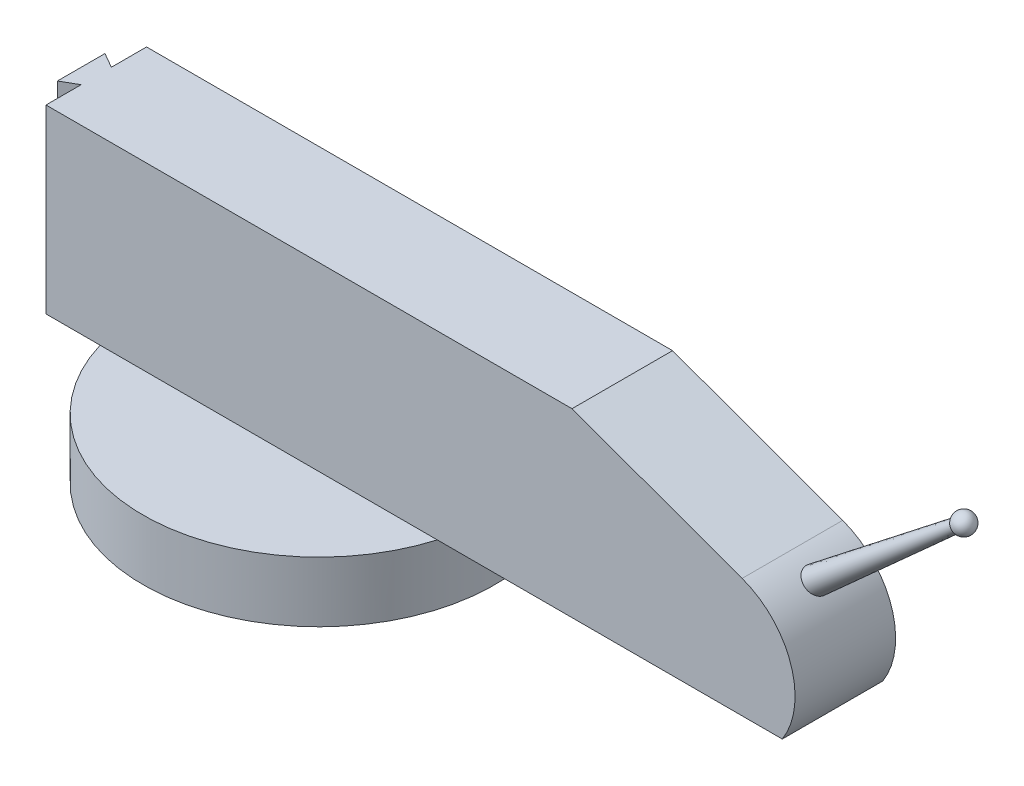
ISO-10303-21;
HEADER;
FILE_DESCRIPTION(('STEP AP214'),'2;1');
FILE_NAME('part.step','',(''),(''),'','','');
FILE_SCHEMA(('AUTOMOTIVE_DESIGN { 1 0 10303 214 1 1 1 1 }'));
ENDSEC;
DATA;
#1=APPLICATION_CONTEXT('core data for automotive mechanical design processes');
#2=APPLICATION_PROTOCOL_DEFINITION('international standard','automotive_design',2000,#1);
#3=PRODUCT_CONTEXT('',#1,'mechanical');
#4=PRODUCT('Part','Part','',(#3));
#5=PRODUCT_RELATED_PRODUCT_CATEGORY('part','',(#4));
#6=PRODUCT_DEFINITION_FORMATION('','',#4);
#7=PRODUCT_DEFINITION_CONTEXT('part definition',#1,'design');
#8=PRODUCT_DEFINITION('design','',#6,#7);
#9=PRODUCT_DEFINITION_SHAPE('','',#8);
#10=(LENGTH_UNIT() NAMED_UNIT(*) SI_UNIT(.MILLI.,.METRE.));
#11=(NAMED_UNIT(*) PLANE_ANGLE_UNIT() SI_UNIT($,.RADIAN.));
#12=(NAMED_UNIT(*) SI_UNIT($,.STERADIAN.) SOLID_ANGLE_UNIT());
#13=UNCERTAINTY_MEASURE_WITH_UNIT(LENGTH_MEASURE(1.E-05),#10,'distance_accuracy_value','');
#14=(GEOMETRIC_REPRESENTATION_CONTEXT(3) GLOBAL_UNCERTAINTY_ASSIGNED_CONTEXT((#13)) GLOBAL_UNIT_ASSIGNED_CONTEXT((#10,
#11,#12)) REPRESENTATION_CONTEXT('',''));
#15=CARTESIAN_POINT('',(0.,0.,0.));
#16=DIRECTION('',(0.,0.,1.));
#17=DIRECTION('',(1.,0.,0.));
#18=AXIS2_PLACEMENT_3D('',#15,#16,#17);
#19=CARTESIAN_POINT('',(0.,0.,10.));
#20=DIRECTION('',(0.,1.,0.));
#21=DIRECTION('',(0.,0.,1.));
#22=AXIS2_PLACEMENT_3D('',#19,#20,#21);
#23=PLANE('',#22);
#24=CARTESIAN_POINT('',(23.6473346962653,0.,5.));
#25=DIRECTION('',(0.,-1.,0.));
#26=DIRECTION('',(0.,0.,-1.));
#27=AXIS2_PLACEMENT_3D('',#24,#25,#26);
#28=CIRCLE('',#27,17.5);
#29=CARTESIAN_POINT('',(40.4178445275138,0.,0.));
#30=VERTEX_POINT('',#29);
#31=CARTESIAN_POINT('',(40.4178445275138,0.,10.));
#32=VERTEX_POINT('',#31);
#33=EDGE_CURVE('E44',#30,#32,#28,.T.);
#34=ORIENTED_EDGE('',*,*,#33,.F.);
#35=DIRECTION('',(1.,0.,0.));
#36=VECTOR('',#35,1.);
#37=CARTESIAN_POINT('',(0.,0.,0.));
#38=LINE('',#37,#36);
#39=CARTESIAN_POINT('',(74.7304290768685,0.,0.));
#40=VERTEX_POINT('',#39);
#41=EDGE_CURVE('E129',#30,#40,#38,.T.);
#42=ORIENTED_EDGE('',*,*,#41,.T.);
#43=DIRECTION('',(0.,0.,-1.));
#44=VECTOR('',#43,1.);
#45=CARTESIAN_POINT('',(74.7304290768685,0.,10.));
#46=LINE('',#45,#44);
#47=CARTESIAN_POINT('',(74.7304290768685,0.,10.));
#48=VERTEX_POINT('',#47);
#49=EDGE_CURVE('E209',#48,#40,#46,.T.);
#50=ORIENTED_EDGE('',*,*,#49,.F.);
#51=DIRECTION('',(1.,0.,0.));
#52=VECTOR('',#51,1.);
#53=CARTESIAN_POINT('',(0.,0.,10.));
#54=LINE('',#53,#52);
#55=EDGE_CURVE('E52',#32,#48,#54,.T.);
#56=ORIENTED_EDGE('',*,*,#55,.F.);
#57=EDGE_LOOP('',(#34,#42,#50,#56));
#58=FACE_BOUND('',#57,.T.);
#59=ADVANCED_FACE('F30',(#58),#23,.F.);
#60=CARTESIAN_POINT('',(6.8768248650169,0.,10.));
#61=VERTEX_POINT('',#60);
#62=CARTESIAN_POINT('',(6.8768248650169,0.,0.));
#63=VERTEX_POINT('',#62);
#64=EDGE_CURVE('E11',#61,#63,#28,.T.);
#65=ORIENTED_EDGE('',*,*,#64,.F.);
#66=CARTESIAN_POINT('',(1.5,0.,10.));
#67=VERTEX_POINT('',#66);
#68=EDGE_CURVE('E189',#67,#61,#54,.T.);
#69=ORIENTED_EDGE('',*,*,#68,.F.);
#70=DIRECTION('',(0.,0.,-1.));
#71=VECTOR('',#70,1.);
#72=CARTESIAN_POINT('',(1.5,0.,10.));
#73=LINE('',#72,#71);
#74=CARTESIAN_POINT('',(1.5,0.,6.5));
#75=VERTEX_POINT('',#74);
#76=EDGE_CURVE('E155',#67,#75,#73,.T.);
#77=ORIENTED_EDGE('',*,*,#76,.T.);
#78=DIRECTION('',(-0.866025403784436,0.,0.500000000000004));
#79=VECTOR('',#78,1.);
#80=CARTESIAN_POINT('',(1.5,0.,6.5));
#81=LINE('',#80,#79);
#82=CARTESIAN_POINT('',(0.,0.,7.36602540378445));
#83=VERTEX_POINT('',#82);
#84=EDGE_CURVE('E158',#75,#83,#81,.T.);
#85=ORIENTED_EDGE('',*,*,#84,.T.);
#86=DIRECTION('',(0.,0.,-1.));
#87=VECTOR('',#86,1.);
#88=CARTESIAN_POINT('',(0.,0.,10.));
#89=LINE('',#88,#87);
#90=CARTESIAN_POINT('',(0.,0.,2.63397459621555));
#91=VERTEX_POINT('',#90);
#92=EDGE_CURVE('E199',#83,#91,#89,.T.);
#93=ORIENTED_EDGE('',*,*,#92,.T.);
#94=DIRECTION('',(0.866025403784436,0.,0.500000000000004));
#95=VECTOR('',#94,1.);
#96=CARTESIAN_POINT('',(1.5,0.,3.5));
#97=LINE('',#96,#95);
#98=CARTESIAN_POINT('',(1.5,0.,3.5));
#99=VERTEX_POINT('',#98);
#100=EDGE_CURVE('E173',#91,#99,#97,.T.);
#101=ORIENTED_EDGE('',*,*,#100,.T.);
#102=DIRECTION('',(0.,0.,-1.));
#103=VECTOR('',#102,1.);
#104=CARTESIAN_POINT('',(1.5,0.,0.));
#105=LINE('',#104,#103);
#106=CARTESIAN_POINT('',(1.5,0.,0.));
#107=VERTEX_POINT('',#106);
#108=EDGE_CURVE('E123',#99,#107,#105,.T.);
#109=ORIENTED_EDGE('',*,*,#108,.T.);
#110=EDGE_CURVE('E118',#107,#63,#38,.T.);
#111=ORIENTED_EDGE('',*,*,#110,.T.);
#112=EDGE_LOOP('',(#65,#69,#77,#85,#93,#101,#109,#111));
#113=FACE_BOUND('',#112,.T.);
#114=ADVANCED_FACE('F120',(#113),#23,.F.);
#115=CARTESIAN_POINT('',(68.,4.32450279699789,10.));
#116=DIRECTION('',(0.,0.,-1.));
#117=DIRECTION('',(-1.,0.,0.));
#118=AXIS2_PLACEMENT_3D('',#115,#116,#117);
#119=CYLINDRICAL_SURFACE('',#118,7.99999999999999);
#120=CARTESIAN_POINT('',(68.,4.32450279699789,0.));
#121=DIRECTION('',(0.,0.,1.));
#122=DIRECTION('',(-1.,0.,0.));
#123=AXIS2_PLACEMENT_3D('',#120,#121,#122);
#124=CIRCLE('',#123,7.99999999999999);
#125=CARTESIAN_POINT('',(70.7361611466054,11.8420437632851,0.));
#126=VERTEX_POINT('',#125);
#127=EDGE_CURVE('E126',#40,#126,#124,.T.);
#128=ORIENTED_EDGE('',*,*,#127,.T.);
#129=DIRECTION('',(0.,0.,-1.));
#130=VECTOR('',#129,1.);
#131=CARTESIAN_POINT('',(70.7361611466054,11.8420437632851,10.));
#132=LINE('',#131,#130);
#133=CARTESIAN_POINT('',(70.7361611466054,11.8420437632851,10.));
#134=VERTEX_POINT('',#133);
#135=EDGE_CURVE('E206',#134,#126,#132,.T.);
#136=ORIENTED_EDGE('',*,*,#135,.F.);
#137=CARTESIAN_POINT('',(68.,4.32450279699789,10.));
#138=DIRECTION('',(0.,0.,1.));
#139=DIRECTION('',(-1.,0.,0.));
#140=AXIS2_PLACEMENT_3D('',#137,#138,#139);
#141=CIRCLE('',#140,7.99999999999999);
#142=EDGE_CURVE('E191',#48,#134,#141,.T.);
#143=ORIENTED_EDGE('',*,*,#142,.F.);
#144=ORIENTED_EDGE('',*,*,#49,.T.);
#145=EDGE_LOOP('',(#128,#136,#143,#144));
#146=FACE_BOUND('',#145,.T.);
#147=CARTESIAN_POINT('',(73.5125753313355,10.1220465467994,3.87749337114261));
#148=CARTESIAN_POINT('',(73.4662022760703,10.1661386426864,3.85098514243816));
#149=CARTESIAN_POINT('',(73.4176359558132,10.2112490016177,3.82989216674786));
#150=CARTESIAN_POINT('',(73.3173880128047,10.3019573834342,3.79906814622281));
#151=CARTESIAN_POINT('',(73.2657030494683,10.3475558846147,3.78934952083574));
#152=CARTESIAN_POINT('',(73.1607225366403,10.437744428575,3.78142861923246));
#153=CARTESIAN_POINT('',(73.1074292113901,10.4823357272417,3.78321110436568));
#154=CARTESIAN_POINT('',(73.0006665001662,10.5693470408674,3.79805306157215));
#155=CARTESIAN_POINT('',(72.9471971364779,10.6117673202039,3.8111111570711));
#156=CARTESIAN_POINT('',(72.8406121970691,10.694204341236,3.84837759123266));
#157=CARTESIAN_POINT('',(72.7875216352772,10.7341618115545,3.87278851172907));
#158=CARTESIAN_POINT('',(72.6843401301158,10.8099527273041,3.93211642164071));
#159=CARTESIAN_POINT('',(72.6342497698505,10.8457853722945,3.9670354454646));
#160=CARTESIAN_POINT('',(72.5377724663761,10.9132930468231,4.0472594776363));
#161=CARTESIAN_POINT('',(72.4914755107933,10.944874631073,4.09275169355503));
#162=CARTESIAN_POINT('',(72.4054000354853,11.0024618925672,4.19258948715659));
#163=CARTESIAN_POINT('',(72.365621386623,11.0284676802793,4.24693488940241));
#164=CARTESIAN_POINT('',(72.2947329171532,11.0740974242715,4.36228775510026));
#165=CARTESIAN_POINT('',(72.2635128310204,11.0938031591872,4.42319485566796));
#166=CARTESIAN_POINT('',(72.2105083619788,11.1268996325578,4.550577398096));
#167=CARTESIAN_POINT('',(72.1887205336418,11.1402926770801,4.61705079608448));
#168=CARTESIAN_POINT('',(72.1565174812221,11.1599767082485,4.75025265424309));
#169=CARTESIAN_POINT('',(72.1456059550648,11.1665781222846,4.81681527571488));
#170=CARTESIAN_POINT('',(72.1339390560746,11.1736339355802,4.9511396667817));
#171=CARTESIAN_POINT('',(72.1331809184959,11.174090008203,5.0189011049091));
#172=CARTESIAN_POINT('',(72.1416818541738,11.1689524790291,5.1508562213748));
#173=CARTESIAN_POINT('',(72.1505469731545,11.1635968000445,5.21508519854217));
#174=CARTESIAN_POINT('',(72.1772401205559,11.1473252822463,5.34091565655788));
#175=CARTESIAN_POINT('',(72.1950684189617,11.1364092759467,5.40251705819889));
#176=CARTESIAN_POINT('',(72.2390749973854,11.1091114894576,5.52201369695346));
#177=CARTESIAN_POINT('',(72.2653264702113,11.0926817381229,5.57987089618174));
#178=CARTESIAN_POINT('',(72.3250432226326,11.0546774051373,5.68988742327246));
#179=CARTESIAN_POINT('',(72.358510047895,11.0331017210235,5.74204552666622));
#180=CARTESIAN_POINT('',(72.4331468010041,10.9840291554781,5.84179722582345));
#181=CARTESIAN_POINT('',(72.4746040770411,10.9563022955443,5.88906266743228));
#182=CARTESIAN_POINT('',(72.5626243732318,10.8960552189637,5.97500918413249));
#183=CARTESIAN_POINT('',(72.6091886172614,10.8635338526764,6.01368819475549));
#184=CARTESIAN_POINT('',(72.707968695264,10.7927998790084,6.08298024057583));
#185=CARTESIAN_POINT('',(72.7603394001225,10.7544062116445,6.11318857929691));
#186=CARTESIAN_POINT('',(72.8673363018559,10.6737957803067,6.16247100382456));
#187=CARTESIAN_POINT('',(72.9219626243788,10.6315788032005,6.18154446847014));
#188=CARTESIAN_POINT('',(73.0321166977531,10.5440506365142,6.20800315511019));
#189=CARTESIAN_POINT('',(73.0876478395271,10.4987229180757,6.2153199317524));
#190=CARTESIAN_POINT('',(73.1976114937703,10.4064419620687,6.21767391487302));
#191=CARTESIAN_POINT('',(73.2520441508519,10.3594889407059,6.21271274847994));
#192=CARTESIAN_POINT('',(73.3570186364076,10.2664857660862,6.19073866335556));
#193=CARTESIAN_POINT('',(73.4076202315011,10.220438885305,6.17399755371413));
#194=CARTESIAN_POINT('',(73.5048674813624,10.1297466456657,6.12911301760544));
#195=CARTESIAN_POINT('',(73.5515136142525,10.0851011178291,6.10097097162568));
#196=CARTESIAN_POINT('',(73.6387125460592,9.99976211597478,6.03475872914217));
#197=CARTESIAN_POINT('',(73.6793752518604,9.95900408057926,5.9969162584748));
#198=CARTESIAN_POINT('',(73.7548810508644,9.88186386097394,5.91207414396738));
#199=CARTESIAN_POINT('',(73.7897243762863,9.84548150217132,5.86507486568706));
#200=CARTESIAN_POINT('',(73.8526725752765,9.77870487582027,5.76361255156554));
#201=CARTESIAN_POINT('',(73.880823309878,9.74827012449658,5.70920458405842));
#202=CARTESIAN_POINT('',(73.9302086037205,9.69423004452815,5.59420883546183));
#203=CARTESIAN_POINT('',(73.9514431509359,9.67062472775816,5.53362104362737));
#204=CARTESIAN_POINT('',(73.9866711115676,9.63114707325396,5.40793655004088));
#205=CARTESIAN_POINT('',(74.0006595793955,9.61528001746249,5.34283680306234));
#206=CARTESIAN_POINT('',(74.0211687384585,9.59192825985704,5.2100104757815));
#207=CARTESIAN_POINT('',(74.0276894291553,9.58444355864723,5.14228389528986));
#208=CARTESIAN_POINT('',(74.0331730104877,9.57815310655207,5.00610300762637));
#209=CARTESIAN_POINT('',(74.0321334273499,9.57935019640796,4.93764846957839));
#210=CARTESIAN_POINT('',(74.0225049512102,9.59038225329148,4.80197944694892));
#211=CARTESIAN_POINT('',(74.0139162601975,9.60021698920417,4.73476492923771));
#212=CARTESIAN_POINT('',(73.9893137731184,9.62813020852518,4.60349551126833));
#213=CARTESIAN_POINT('',(73.9733015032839,9.64620699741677,4.53943996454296));
#214=CARTESIAN_POINT('',(73.9340861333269,9.68989921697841,4.41627574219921));
#215=CARTESIAN_POINT('',(73.9108815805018,9.71551617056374,4.35716806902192));
#216=CARTESIAN_POINT('',(73.8576510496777,9.77330675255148,4.2455610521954));
#217=CARTESIAN_POINT('',(73.827621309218,9.80548399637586,4.19306537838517));
#218=CARTESIAN_POINT('',(73.7613095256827,9.87514351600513,4.09624058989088));
#219=CARTESIAN_POINT('',(73.7250339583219,9.91262029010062,4.0519031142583));
#220=CARTESIAN_POINT('',(73.6594671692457,9.97886922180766,3.98526846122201));
#221=CARTESIAN_POINT('',(73.6316432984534,10.0066007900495,3.960453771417));
#222=CARTESIAN_POINT('',(73.5737329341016,10.0634180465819,3.91544682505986));
#223=CARTESIAN_POINT('',(73.5436464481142,10.0925037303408,3.89525455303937));
#224=CARTESIAN_POINT('',(73.5125753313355,10.1220465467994,3.87749337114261));
#225=B_SPLINE_CURVE_WITH_KNOTS('',3,(#147,#148,#149,#150,#151,#152,#153,#154,#155,#156,#157,
#158,#159,#160,#161,#162,#163,#164,#165,#166,#167,#168,#169,#170,#171,#172,#173,#174,#175,#176,
#177,#178,#179,#180,#181,#182,#183,#184,#185,#186,#187,#188,#189,#190,#191,#192,#193,#194,#195,
#196,#197,#198,#199,#200,#201,#202,#203,#204,#205,#206,#207,#208,#209,#210,#211,#212,#213,#214,
#215,#216,#217,#218,#219,#220,#221,#222,#223,#224),.UNSPECIFIED.,.T.,.F.,(4,2,2,2,2,2,2,2,2,2,2,
2,2,2,2,2,2,2,2,2,2,2,2,2,2,2,2,2,2,2,2,2,2,2,2,2,2,2,4),(0.,0.207614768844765,0.41545601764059,
0.623021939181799,0.83056252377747,1.04195762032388,1.25339367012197,1.46890494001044,
1.68441193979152,1.89699579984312,2.10950194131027,2.31179367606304,2.51403032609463,
2.70828965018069,2.90255482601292,3.09855597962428,3.29459916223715,3.49982331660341,
3.70509676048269,3.91894985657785,4.13281488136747,4.34792053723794,4.5629976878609,
4.77326831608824,4.9835134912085,5.18921458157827,5.39490746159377,5.59914735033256,
5.80338759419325,6.00776705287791,6.21214652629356,6.41659287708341,6.62103375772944,
6.82543262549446,7.02987280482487,7.23442595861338,7.43876829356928,7.57787589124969,
7.71698302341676),.UNSPECIFIED.);
#226=CARTESIAN_POINT('',(73.5125753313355,10.1220465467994,3.87749337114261));
#227=VERTEX_POINT('',#226);
#228=EDGE_CURVE('E42',#227,#227,#225,.T.);
#229=ORIENTED_EDGE('',*,*,#228,.F.);
#230=EDGE_LOOP('',(#229));
#231=FACE_BOUND('',#230,.T.);
#232=ADVANCED_FACE('F214',(#146,#231),#119,.T.);
#233=CARTESIAN_POINT('',(53.8173154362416,18.,10.));
#234=DIRECTION('',(-0.34202014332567,-0.939692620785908,0.));
#235=DIRECTION('',(0.939692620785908,-0.34202014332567,0.));
#236=AXIS2_PLACEMENT_3D('',#233,#234,#235);
#237=PLANE('',#236);
#238=DIRECTION('',(-0.939692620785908,0.34202014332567,0.));
#239=VECTOR('',#238,1.);
#240=CARTESIAN_POINT('',(53.8173154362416,18.,0.));
#241=LINE('',#240,#239);
#242=CARTESIAN_POINT('',(53.8173154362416,18.,0.));
#243=VERTEX_POINT('',#242);
#244=EDGE_CURVE('E184',#126,#243,#241,.T.);
#245=ORIENTED_EDGE('',*,*,#244,.T.);
#246=DIRECTION('',(0.,0.,-1.));
#247=VECTOR('',#246,1.);
#248=CARTESIAN_POINT('',(53.8173154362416,18.,10.));
#249=LINE('',#248,#247);
#250=CARTESIAN_POINT('',(53.8173154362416,18.,10.));
#251=VERTEX_POINT('',#250);
#252=EDGE_CURVE('E203',#251,#243,#249,.T.);
#253=ORIENTED_EDGE('',*,*,#252,.F.);
#254=DIRECTION('',(-0.939692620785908,0.34202014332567,0.));
#255=VECTOR('',#254,1.);
#256=CARTESIAN_POINT('',(53.8173154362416,18.,10.));
#257=LINE('',#256,#255);
#258=EDGE_CURVE('E194',#134,#251,#257,.T.);
#259=ORIENTED_EDGE('',*,*,#258,.F.);
#260=ORIENTED_EDGE('',*,*,#135,.T.);
#261=EDGE_LOOP('',(#245,#253,#259,#260));
#262=FACE_BOUND('',#261,.T.);
#263=ADVANCED_FACE('F253',(#262),#237,.F.);
#264=CARTESIAN_POINT('',(0.,18.,10.));
#265=DIRECTION('',(0.,-1.,0.));
#266=DIRECTION('',(0.,0.,-1.));
#267=AXIS2_PLACEMENT_3D('',#264,#265,#266);
#268=PLANE('',#267);
#269=DIRECTION('',(0.,0.,-1.));
#270=VECTOR('',#269,1.);
#271=CARTESIAN_POINT('',(0.,18.,10.));
#272=LINE('',#271,#270);
#273=CARTESIAN_POINT('',(0.,18.,7.36602540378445));
#274=VERTEX_POINT('',#273);
#275=CARTESIAN_POINT('',(0.,18.,2.63397459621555));
#276=VERTEX_POINT('',#275);
#277=EDGE_CURVE('E201',#274,#276,#272,.T.);
#278=ORIENTED_EDGE('',*,*,#277,.F.);
#279=DIRECTION('',(-0.866025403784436,0.,0.500000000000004));
#280=VECTOR('',#279,1.);
#281=CARTESIAN_POINT('',(1.5,18.,6.5));
#282=LINE('',#281,#280);
#283=CARTESIAN_POINT('',(1.5,18.,6.5));
#284=VERTEX_POINT('',#283);
#285=EDGE_CURVE('E153',#284,#274,#282,.T.);
#286=ORIENTED_EDGE('',*,*,#285,.F.);
#287=DIRECTION('',(0.,0.,-1.));
#288=VECTOR('',#287,1.);
#289=CARTESIAN_POINT('',(1.5,18.,10.));
#290=LINE('',#289,#288);
#291=CARTESIAN_POINT('',(1.5,18.,10.));
#292=VERTEX_POINT('',#291);
#293=EDGE_CURVE('E150',#292,#284,#290,.T.);
#294=ORIENTED_EDGE('',*,*,#293,.F.);
#295=DIRECTION('',(-1.,0.,0.));
#296=VECTOR('',#295,1.);
#297=CARTESIAN_POINT('',(0.,18.,10.));
#298=LINE('',#297,#296);
#299=EDGE_CURVE('E196',#251,#292,#298,.T.);
#300=ORIENTED_EDGE('',*,*,#299,.F.);
#301=ORIENTED_EDGE('',*,*,#252,.T.);
#302=DIRECTION('',(-1.,0.,0.));
#303=VECTOR('',#302,1.);
#304=CARTESIAN_POINT('',(0.,18.,0.));
#305=LINE('',#304,#303);
#306=CARTESIAN_POINT('',(1.5,18.,0.));
#307=VERTEX_POINT('',#306);
#308=EDGE_CURVE('E186',#243,#307,#305,.T.);
#309=ORIENTED_EDGE('',*,*,#308,.T.);
#310=DIRECTION('',(0.,0.,-1.));
#311=VECTOR('',#310,1.);
#312=CARTESIAN_POINT('',(1.5,18.,0.));
#313=LINE('',#312,#311);
#314=CARTESIAN_POINT('',(1.5,18.,3.5));
#315=VERTEX_POINT('',#314);
#316=EDGE_CURVE('E171',#315,#307,#313,.T.);
#317=ORIENTED_EDGE('',*,*,#316,.F.);
#318=DIRECTION('',(0.866025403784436,0.,0.500000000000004));
#319=VECTOR('',#318,1.);
#320=CARTESIAN_POINT('',(1.5,18.,3.5));
#321=LINE('',#320,#319);
#322=EDGE_CURVE('E165',#276,#315,#321,.T.);
#323=ORIENTED_EDGE('',*,*,#322,.F.);
#324=EDGE_LOOP('',(#278,#286,#294,#300,#301,#309,#317,#323));
#325=FACE_BOUND('',#324,.T.);
#326=ADVANCED_FACE('F250',(#325),#268,.F.);
#327=CARTESIAN_POINT('',(0.,0.,10.));
#328=DIRECTION('',(1.,0.,0.));
#329=DIRECTION('',(0.,0.,-1.));
#330=AXIS2_PLACEMENT_3D('',#327,#328,#329);
#331=PLANE('',#330);
#332=ORIENTED_EDGE('',*,*,#92,.F.);
#333=DIRECTION('',(0.,1.,0.));
#334=VECTOR('',#333,1.);
#335=CARTESIAN_POINT('',(0.,0.,7.36602540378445));
#336=LINE('',#335,#334);
#337=EDGE_CURVE('E162',#83,#274,#336,.T.);
#338=ORIENTED_EDGE('',*,*,#337,.T.);
#339=ORIENTED_EDGE('',*,*,#277,.T.);
#340=DIRECTION('',(0.,1.,0.));
#341=VECTOR('',#340,1.);
#342=CARTESIAN_POINT('',(0.,0.,2.63397459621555));
#343=LINE('',#342,#341);
#344=EDGE_CURVE('E176',#91,#276,#343,.T.);
#345=ORIENTED_EDGE('',*,*,#344,.F.);
#346=EDGE_LOOP('',(#332,#338,#339,#345));
#347=FACE_BOUND('',#346,.T.);
#348=ADVANCED_FACE('F246',(#347),#331,.F.);
#349=CARTESIAN_POINT('',(68.,4.32450279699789,10.));
#350=DIRECTION('',(0.,0.,-1.));
#351=DIRECTION('',(-1.,0.,0.));
#352=AXIS2_PLACEMENT_3D('',#349,#350,#351);
#353=PLANE('',#352);
#354=ORIENTED_EDGE('',*,*,#299,.T.);
#355=DIRECTION('',(0.,1.,0.));
#356=VECTOR('',#355,1.);
#357=CARTESIAN_POINT('',(1.5,0.,10.));
#358=LINE('',#357,#356);
#359=EDGE_CURVE('E161',#67,#292,#358,.T.);
#360=ORIENTED_EDGE('',*,*,#359,.F.);
#361=ORIENTED_EDGE('',*,*,#68,.T.);
#362=EDGE_CURVE('E192',#61,#32,#54,.T.);
#363=ORIENTED_EDGE('',*,*,#362,.T.);
#364=ORIENTED_EDGE('',*,*,#55,.T.);
#365=ORIENTED_EDGE('',*,*,#142,.T.);
#366=ORIENTED_EDGE('',*,*,#258,.T.);
#367=EDGE_LOOP('',(#354,#360,#361,#363,#364,#365,#366));
#368=FACE_BOUND('',#367,.T.);
#369=ADVANCED_FACE('F243',(#368),#353,.F.);
#370=CARTESIAN_POINT('',(68.,4.32450279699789,0.));
#371=DIRECTION('',(0.,0.,-1.));
#372=DIRECTION('',(-1.,0.,0.));
#373=AXIS2_PLACEMENT_3D('',#370,#371,#372);
#374=PLANE('',#373);
#375=DIRECTION('',(0.,1.,0.));
#376=VECTOR('',#375,1.);
#377=CARTESIAN_POINT('',(1.5,0.,0.));
#378=LINE('',#377,#376);
#379=EDGE_CURVE('E177',#107,#307,#378,.T.);
#380=ORIENTED_EDGE('',*,*,#379,.T.);
#381=ORIENTED_EDGE('',*,*,#308,.F.);
#382=ORIENTED_EDGE('',*,*,#244,.F.);
#383=ORIENTED_EDGE('',*,*,#127,.F.);
#384=ORIENTED_EDGE('',*,*,#41,.F.);
#385=EDGE_CURVE('E127',#63,#30,#38,.T.);
#386=ORIENTED_EDGE('',*,*,#385,.F.);
#387=ORIENTED_EDGE('',*,*,#110,.F.);
#388=EDGE_LOOP('',(#380,#381,#382,#383,#384,#386,#387));
#389=FACE_BOUND('',#388,.T.);
#390=ADVANCED_FACE('F133',(#389),#374,.T.);
#391=CARTESIAN_POINT('',(1.5,0.,0.));
#392=DIRECTION('',(1.,0.,0.));
#393=DIRECTION('',(0.,0.,-1.));
#394=AXIS2_PLACEMENT_3D('',#391,#392,#393);
#395=PLANE('',#394);
#396=ORIENTED_EDGE('',*,*,#316,.T.);
#397=ORIENTED_EDGE('',*,*,#379,.F.);
#398=ORIENTED_EDGE('',*,*,#108,.F.);
#399=DIRECTION('',(0.,1.,0.));
#400=VECTOR('',#399,1.);
#401=CARTESIAN_POINT('',(1.5,0.,3.5));
#402=LINE('',#401,#400);
#403=EDGE_CURVE('E179',#99,#315,#402,.T.);
#404=ORIENTED_EDGE('',*,*,#403,.T.);
#405=EDGE_LOOP('',(#396,#397,#398,#404));
#406=FACE_BOUND('',#405,.T.);
#407=ADVANCED_FACE('F234',(#406),#395,.F.);
#408=CARTESIAN_POINT('',(1.5,0.,3.5));
#409=DIRECTION('',(-0.500000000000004,0.,0.866025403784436));
#410=DIRECTION('',(0.866025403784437,0.,0.500000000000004));
#411=AXIS2_PLACEMENT_3D('',#408,#409,#410);
#412=PLANE('',#411);
#413=ORIENTED_EDGE('',*,*,#322,.T.);
#414=ORIENTED_EDGE('',*,*,#403,.F.);
#415=ORIENTED_EDGE('',*,*,#100,.F.);
#416=ORIENTED_EDGE('',*,*,#344,.T.);
#417=EDGE_LOOP('',(#413,#414,#415,#416));
#418=FACE_BOUND('',#417,.T.);
#419=ADVANCED_FACE('F229',(#418),#412,.F.);
#420=CARTESIAN_POINT('',(1.5,0.,6.5));
#421=DIRECTION('',(-0.500000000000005,0.,-0.866025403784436));
#422=DIRECTION('',(-0.866025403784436,0.,0.500000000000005));
#423=AXIS2_PLACEMENT_3D('',#420,#421,#422);
#424=PLANE('',#423);
#425=ORIENTED_EDGE('',*,*,#285,.T.);
#426=ORIENTED_EDGE('',*,*,#337,.F.);
#427=ORIENTED_EDGE('',*,*,#84,.F.);
#428=DIRECTION('',(0.,1.,0.));
#429=VECTOR('',#428,1.);
#430=CARTESIAN_POINT('',(1.5,0.,6.5));
#431=LINE('',#430,#429);
#432=EDGE_CURVE('E166',#75,#284,#431,.T.);
#433=ORIENTED_EDGE('',*,*,#432,.T.);
#434=EDGE_LOOP('',(#425,#426,#427,#433));
#435=FACE_BOUND('',#434,.T.);
#436=ADVANCED_FACE('F225',(#435),#424,.F.);
#437=CARTESIAN_POINT('',(1.5,0.,10.));
#438=DIRECTION('',(1.,0.,0.));
#439=DIRECTION('',(0.,0.,-1.));
#440=AXIS2_PLACEMENT_3D('',#437,#438,#439);
#441=PLANE('',#440);
#442=ORIENTED_EDGE('',*,*,#293,.T.);
#443=ORIENTED_EDGE('',*,*,#432,.F.);
#444=ORIENTED_EDGE('',*,*,#76,.F.);
#445=ORIENTED_EDGE('',*,*,#359,.T.);
#446=EDGE_LOOP('',(#442,#443,#444,#445));
#447=FACE_BOUND('',#446,.T.);
#448=ADVANCED_FACE('F222',(#447),#441,.F.);
#449=CARTESIAN_POINT('',(72.4324762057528,9.8204541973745,5.));
#450=DIRECTION('',(-0.76604444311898,-0.642787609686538,0.));
#451=DIRECTION('',(-0.642787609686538,0.76604444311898,0.));
#452=AXIS2_PLACEMENT_3D('',#449,#450,#451);
#453=CONICAL_SURFACE('',#452,1.25,0.0349065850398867);
#454=CARTESIAN_POINT('',(87.2799876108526,21.9531806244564,4.4759203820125));
#455=CARTESIAN_POINT('',(87.2976391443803,21.9295708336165,4.48987489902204));
#456=CARTESIAN_POINT('',(87.3146024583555,21.9068897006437,4.506326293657));
#457=CARTESIAN_POINT('',(87.346654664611,21.8640460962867,4.54376328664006));
#458=CARTESIAN_POINT('',(87.3617413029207,21.8438866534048,4.56475425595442));
#459=CARTESIAN_POINT('',(87.3895868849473,21.8066871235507,4.61066119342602));
#460=CARTESIAN_POINT('',(87.4023467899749,21.7896457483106,4.63557553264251));
#461=CARTESIAN_POINT('',(87.4251742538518,21.7591644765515,4.68862162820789));
#462=CARTESIAN_POINT('',(87.435242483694,21.7457236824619,4.71675258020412));
#463=CARTESIAN_POINT('',(87.4523922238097,21.7228322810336,4.77540859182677));
#464=CARTESIAN_POINT('',(87.4594767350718,21.7133776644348,4.80593120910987));
#465=CARTESIAN_POINT('',(87.4704691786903,21.6987087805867,4.86852918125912));
#466=CARTESIAN_POINT('',(87.4743770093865,21.6934946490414,4.90060458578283));
#467=CARTESIAN_POINT('',(87.4789000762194,21.6874596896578,4.9653567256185));
#468=CARTESIAN_POINT('',(87.4795191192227,21.6866337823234,4.99803272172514));
#469=CARTESIAN_POINT('',(87.4774569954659,21.6893851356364,5.06309375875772));
#470=CARTESIAN_POINT('',(87.4747758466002,21.6929623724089,5.09547880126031));
#471=CARTESIAN_POINT('',(87.4661923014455,21.7044159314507,5.15902703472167));
#472=CARTESIAN_POINT('',(87.4602910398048,21.7122907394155,5.1901906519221));
#473=CARTESIAN_POINT('',(87.4454380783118,21.7321142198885,5.25042476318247));
#474=CARTESIAN_POINT('',(87.436486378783,21.7440628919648,5.27949525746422));
#475=CARTESIAN_POINT('',(87.415783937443,21.77170242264,5.33473653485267));
#476=CARTESIAN_POINT('',(87.4040316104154,21.7873954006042,5.36090566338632));
#477=CARTESIAN_POINT('',(87.3780677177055,21.8220744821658,5.40958622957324));
#478=CARTESIAN_POINT('',(87.3638561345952,21.841060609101,5.43209764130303));
#479=CARTESIAN_POINT('',(87.3333605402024,21.8818142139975,5.47285470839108));
#480=CARTESIAN_POINT('',(87.31707392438,21.9035851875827,5.49109491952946));
#481=CARTESIAN_POINT('',(87.2829072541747,21.9492730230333,5.52275965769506));
#482=CARTESIAN_POINT('',(87.2650271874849,21.9731899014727,5.53618414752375));
#483=CARTESIAN_POINT('',(87.2281549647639,22.0225297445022,5.55785670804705));
#484=CARTESIAN_POINT('',(87.2091612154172,22.0479548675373,5.56609715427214));
#485=CARTESIAN_POINT('',(87.1706253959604,22.0995594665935,5.5771392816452));
#486=CARTESIAN_POINT('',(87.1510833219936,22.1257389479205,5.57994092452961));
#487=CARTESIAN_POINT('',(87.1119842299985,22.1781390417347,5.58002715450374));
#488=CARTESIAN_POINT('',(87.0924272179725,22.2043596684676,5.57730591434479));
#489=CARTESIAN_POINT('',(87.0538736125,22.2560702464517,5.56641143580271));
#490=CARTESIAN_POINT('',(87.0348770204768,22.2815601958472,5.55823818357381));
#491=CARTESIAN_POINT('',(86.9979796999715,22.3310887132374,5.53666808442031));
#492=CARTESIAN_POINT('',(86.9800791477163,22.3551270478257,5.52327040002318));
#493=CARTESIAN_POINT('',(86.9458849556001,22.4010622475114,5.49162928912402));
#494=CARTESIAN_POINT('',(86.9295913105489,22.4229591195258,5.47338587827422));
#495=CARTESIAN_POINT('',(86.8990868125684,22.4639668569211,5.43258670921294));
#496=CARTESIAN_POINT('',(86.8848741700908,22.4830801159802,5.41003469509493));
#497=CARTESIAN_POINT('',(86.8589186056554,22.5179946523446,5.36124647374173));
#498=CARTESIAN_POINT('',(86.8471756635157,22.5337959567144,5.33501029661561));
#499=CARTESIAN_POINT('',(86.8265098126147,22.5616096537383,5.2796419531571));
#500=CARTESIAN_POINT('',(86.817582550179,22.5736278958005,5.2505143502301));
#501=CARTESIAN_POINT('',(86.8027771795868,22.5935622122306,5.19015636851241));
#502=CARTESIAN_POINT('',(86.7968990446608,22.6014783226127,5.15892600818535));
#503=CARTESIAN_POINT('',(86.7883659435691,22.6129706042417,5.09530073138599));
#504=CARTESIAN_POINT('',(86.7857060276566,22.6165534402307,5.06290768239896));
#505=CARTESIAN_POINT('',(86.7836684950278,22.6192979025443,4.99783246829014));
#506=CARTESIAN_POINT('',(86.7842908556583,22.6184595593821,4.96515030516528));
#507=CARTESIAN_POINT('',(86.7887983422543,22.6123883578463,4.9004515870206));
#508=CARTESIAN_POINT('',(86.7926809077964,22.6071589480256,4.86843452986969));
#509=CARTESIAN_POINT('',(86.8035952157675,22.592460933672,4.80594767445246));
#510=CARTESIAN_POINT('',(86.8106269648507,22.5829923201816,4.77547787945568));
#511=CARTESIAN_POINT('',(86.8276433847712,22.5600841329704,4.71693776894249));
#512=CARTESIAN_POINT('',(86.8376291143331,22.5466431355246,4.68886831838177));
#513=CARTESIAN_POINT('',(86.8602699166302,22.5161769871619,4.63593404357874));
#514=CARTESIAN_POINT('',(86.8729250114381,22.4991518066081,4.61106924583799));
#515=CARTESIAN_POINT('',(86.9005657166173,22.46197871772,4.56521386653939));
#516=CARTESIAN_POINT('',(86.9155544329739,22.4418266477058,4.54422853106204));
#517=CARTESIAN_POINT('',(86.9474259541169,22.3989919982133,4.50676475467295));
#518=CARTESIAN_POINT('',(86.9643087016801,22.3763094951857,4.4902861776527));
#519=CARTESIAN_POINT('',(86.999519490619,22.3290215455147,4.46227579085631));
#520=CARTESIAN_POINT('',(87.0178497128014,22.3044131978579,4.45075162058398));
#521=CARTESIAN_POINT('',(87.0554199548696,22.253995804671,4.43300885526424));
#522=CARTESIAN_POINT('',(87.0746602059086,22.2281864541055,4.42679161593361));
#523=CARTESIAN_POINT('',(87.113532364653,22.1760637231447,4.41983514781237));
#524=CARTESIAN_POINT('',(87.1331648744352,22.1497495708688,4.41910511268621));
#525=CARTESIAN_POINT('',(87.1722179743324,22.0974261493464,4.42317107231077));
#526=CARTESIAN_POINT('',(87.1916387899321,22.0714165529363,4.42796045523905));
#527=CARTESIAN_POINT('',(87.222609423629,22.029954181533,4.44011496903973));
#528=CARTESIAN_POINT('',(87.2343938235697,22.0141814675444,4.44585365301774));
#529=CARTESIAN_POINT('',(87.2575385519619,21.9832105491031,4.45937323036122));
#530=CARTESIAN_POINT('',(87.2688988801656,21.968012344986,4.46715412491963));
#531=CARTESIAN_POINT('',(87.2799876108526,21.9531806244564,4.4759203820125));
#532=B_SPLINE_CURVE_WITH_KNOTS('',3,(#454,#455,#456,#457,#458,#459,#460,#461,#462,#463,#464,
#465,#466,#467,#468,#469,#470,#471,#472,#473,#474,#475,#476,#477,#478,#479,#480,#481,#482,#483,
#484,#485,#486,#487,#488,#489,#490,#491,#492,#493,#494,#495,#496,#497,#498,#499,#500,#501,#502,
#503,#504,#505,#506,#507,#508,#509,#510,#511,#512,#513,#514,#515,#516,#517,#518,#519,#520,#521,
#522,#523,#524,#525,#526,#527,#528,#529,#530,#531),.UNSPECIFIED.,.T.,.F.,(4,2,2,2,2,2,2,2,2,2,2,
2,2,2,2,2,2,2,2,2,2,2,2,2,2,2,2,2,2,2,2,2,2,2,2,2,2,2,4),(0.,0.0977698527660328,
0.195656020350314,0.293501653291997,0.391322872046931,0.489045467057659,0.586771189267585,
0.684383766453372,0.781995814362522,0.879573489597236,0.977151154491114,1.07478418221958,
1.17241790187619,1.27017539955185,1.36793365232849,1.46583534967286,1.56373773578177,
1.66174347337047,1.75974945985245,1.85777116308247,1.95579254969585,2.05372914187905,
2.15166493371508,2.24944854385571,2.34723129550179,2.44486346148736,2.54249495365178,
2.64004984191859,2.73760493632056,2.83519503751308,2.93278594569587,3.03050787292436,
3.12822684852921,3.22609596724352,3.32399008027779,3.42204817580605,3.51998892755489,
3.58140811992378,3.64282734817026),.UNSPECIFIED.);
#533=CARTESIAN_POINT('',(87.2799876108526,21.9531806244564,4.4759203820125));
#534=VERTEX_POINT('',#533);
#535=EDGE_CURVE('E33',#534,#534,#532,.T.);
#536=ORIENTED_EDGE('',*,*,#535,.T.);
#537=EDGE_LOOP('',(#536));
#538=FACE_BOUND('',#537,.T.);
#539=ORIENTED_EDGE('',*,*,#228,.T.);
#540=EDGE_LOOP('',(#539));
#541=FACE_BOUND('',#540,.T.);
#542=ADVANCED_FACE('F217',(#538,#541),#453,.T.);
#543=CARTESIAN_POINT('',(23.6473346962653,0.,5.));
#544=DIRECTION('',(0.,-1.,0.));
#545=DIRECTION('',(0.,0.,-1.));
#546=AXIS2_PLACEMENT_3D('',#543,#544,#545);
#547=PLANE('',#546);
#548=EDGE_CURVE('E137',#63,#30,#28,.T.);
#549=ORIENTED_EDGE('',*,*,#548,.F.);
#550=ORIENTED_EDGE('',*,*,#385,.T.);
#551=EDGE_LOOP('',(#549,#550));
#552=FACE_BOUND('',#551,.T.);
#553=ADVANCED_FACE('F138',(#552),#547,.F.);
#554=CARTESIAN_POINT('',(23.6473346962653,-6.,5.));
#555=DIRECTION('',(0.,1.,0.));
#556=DIRECTION('',(0.,0.,1.));
#557=AXIS2_PLACEMENT_3D('',#554,#555,#556);
#558=CYLINDRICAL_SURFACE('',#557,17.5);
#559=CARTESIAN_POINT('',(23.6473346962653,-6.,5.));
#560=DIRECTION('',(0.,-1.,0.));
#561=DIRECTION('',(0.,0.,-1.));
#562=AXIS2_PLACEMENT_3D('',#559,#560,#561);
#563=CIRCLE('',#562,17.5);
#564=CARTESIAN_POINT('',(23.6473346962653,-6.,-12.5));
#565=VERTEX_POINT('',#564);
#566=EDGE_CURVE('E146',#565,#565,#563,.T.);
#567=ORIENTED_EDGE('',*,*,#566,.F.);
#568=EDGE_LOOP('',(#567));
#569=FACE_BOUND('',#568,.T.);
#570=ORIENTED_EDGE('',*,*,#33,.T.);
#571=EDGE_CURVE('E45',#32,#61,#28,.T.);
#572=ORIENTED_EDGE('',*,*,#571,.T.);
#573=ORIENTED_EDGE('',*,*,#64,.T.);
#574=ORIENTED_EDGE('',*,*,#548,.T.);
#575=EDGE_LOOP('',(#570,#572,#573,#574));
#576=FACE_BOUND('',#575,.T.);
#577=ADVANCED_FACE('F142',(#569,#576),#558,.T.);
#578=CARTESIAN_POINT('',(23.6473346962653,-6.,5.));
#579=DIRECTION('',(0.,-1.,0.));
#580=DIRECTION('',(0.,0.,-1.));
#581=AXIS2_PLACEMENT_3D('',#578,#579,#580);
#582=PLANE('',#581);
#583=ORIENTED_EDGE('',*,*,#566,.T.);
#584=EDGE_LOOP('',(#583));
#585=FACE_BOUND('',#584,.T.);
#586=ADVANCED_FACE('F276',(#585),#582,.T.);
#587=ORIENTED_EDGE('',*,*,#362,.F.);
#588=ORIENTED_EDGE('',*,*,#571,.F.);
#589=EDGE_LOOP('',(#587,#588));
#590=FACE_BOUND('',#589,.T.);
#591=ADVANCED_FACE('F273',(#590),#547,.F.);
#592=CARTESIAN_POINT('',(87.7839885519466,22.6397107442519,5.));
#593=DIRECTION('',(0.658504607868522,-0.752576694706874,0.));
#594=DIRECTION('',(-0.752576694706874,-0.658504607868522,0.));
#595=AXIS2_PLACEMENT_3D('',#592,#593,#594);
#596=SPHERICAL_SURFACE('',#595,1.);
#597=ORIENTED_EDGE('',*,*,#535,.F.);
#598=EDGE_LOOP('',(#597));
#599=FACE_BOUND('',#598,.T.);
#600=ADVANCED_FACE('F275',(#599),#596,.T.);
#601=CLOSED_SHELL('',(#59,#114,#232,#263,#326,#348,#369,#390,#407,#419,#436,#448,#542,#553,#577,
#586,#591,#600));
#602=MANIFOLD_SOLID_BREP('B2',#601);
#603=ADVANCED_BREP_SHAPE_REPRESENTATION('',(#18,#602),#14);
#604=SHAPE_DEFINITION_REPRESENTATION(#9,#603);
ENDSEC;
END-ISO-10303-21;
